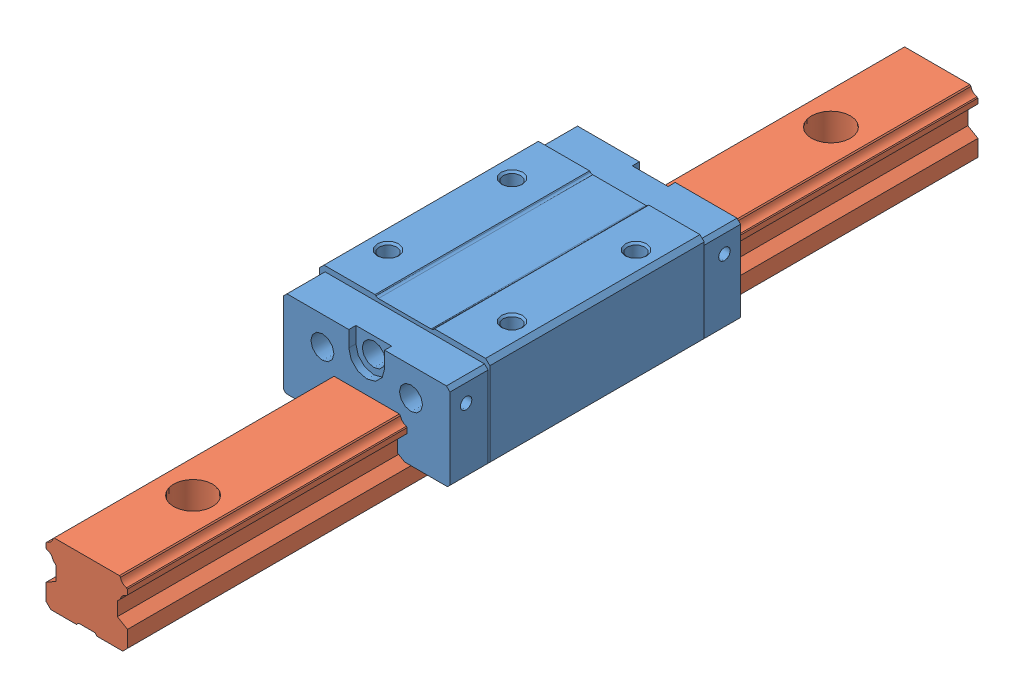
SolidWorks assembly IAS01-H33-L240.sldasm, configuration Default (file format 13000). Lengths in mm.
Overall size (48 33.01 240).
2 component instances, 2 part files, 0 mates.
Components (placement in the parent):
- ELH25CA-1: ELH25CA.SLDPRT [Default] at (0 33 -79) size (48 26 82)
- ELR25R240 E=30-1: ELR25R240 E=30.SLDPRT [Default] at (0 33 0) size (23 18 240)
